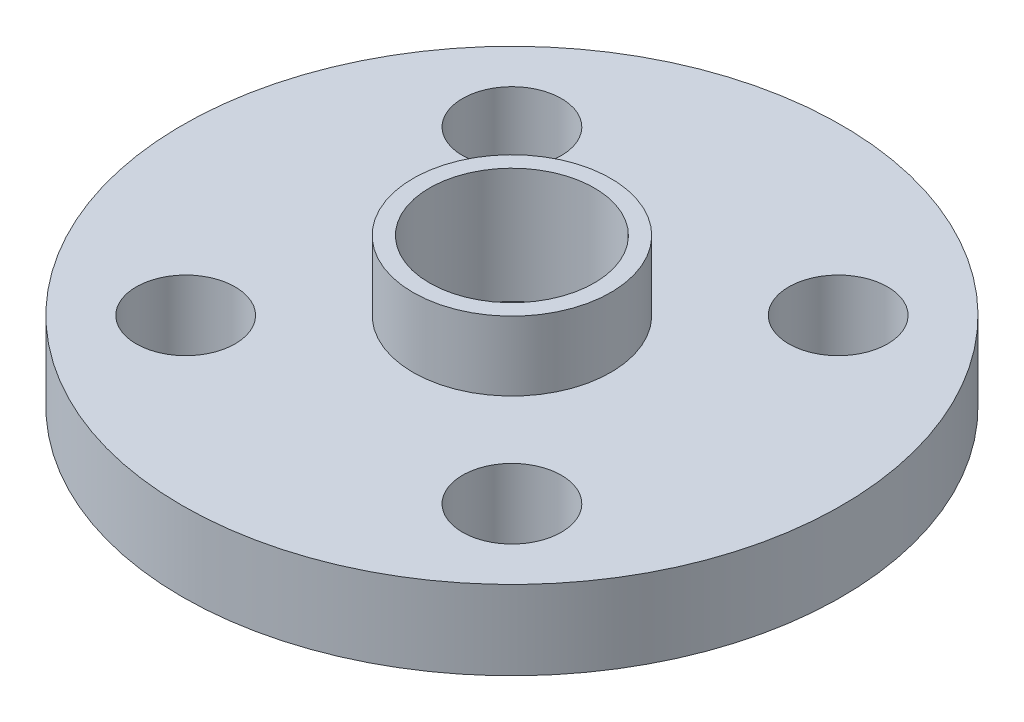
from build123d import *

# Parameters (mm, degrees)
BOSS_EXTRUDE1_DEPTH      = 2.4
BOSS_EXTRUDE1_DEPTH_BACK = 0.0001
SKETCH1_R                = 10
SKETCH1_R_2              = 1.5
SKETCH2_R                = 3
SKETCH2_R_2              = 2.5
BOSS_EXTRUDE2_DEPTH      = 2.1
CUT_EXTRUDE1_START       = -1.4
SKETCH7_R                = 2.5
CUT_EXTRUDE1_DEPTH       = 1.4
SKETCH8_R                = 1.5
CUT_EXTRUDE2_DEPTH       = 1.4


with BuildPart() as part:
    # Sketch1 → Boss-Extrude1 (new, two sides: drawn at the far end of the back side and taken through both)
    with BuildSketch(Plane(origin=(0, 0, 0), x_dir=(1, 0, 0), z_dir=(0, 1, 0)).offset(-BOSS_EXTRUDE1_DEPTH_BACK)):
        with Locations(Location((0, 0, 0), (0, 0, 270))):
            Circle(SKETCH1_R)
        with Locations(Location((4.949747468, -4.949747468, 0), (0, 0, 270))):
            Circle(SKETCH1_R_2, mode=Mode.SUBTRACT)
        with Locations(Location((-4.949747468, -4.949747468, 0), (0, 0, 270))):
            Circle(SKETCH1_R_2, mode=Mode.SUBTRACT)
        with Locations(Location((-4.949747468, 4.949747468, 0), (0, 0, 270))):
            Circle(SKETCH1_R_2, mode=Mode.SUBTRACT)
        with Locations(Location((4.949747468, 4.949747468, 0), (0, 0, 270))):
            Circle(SKETCH1_R_2, mode=Mode.SUBTRACT)
    extrude(amount=BOSS_EXTRUDE1_DEPTH + BOSS_EXTRUDE1_DEPTH_BACK)

    # Sketch2 → Boss-Extrude2 (add)
    with BuildSketch(Plane(origin=(0, 2.4, 0), x_dir=(1, 0, 0), z_dir=(0, 1, 0))):
        with Locations(Location((0, 0, 0), (0, 0, 270))):
            Circle(SKETCH2_R)
        with Locations(Location((0, 0, 0), (0, 0, 270))):
            Circle(SKETCH2_R_2, mode=Mode.SUBTRACT)
    extrude(amount=BOSS_EXTRUDE2_DEPTH)

    # Sketch7 → Cut-Extrude1 (cut)
    with BuildSketch(Plane(origin=(0, 2.4, 0), x_dir=(1, 0, 0), z_dir=(0, 1, 0)).offset(CUT_EXTRUDE1_START)):
        with Locations(Location((0, 0, 0), (0, 0, 270))):
            Circle(SKETCH7_R)
    extrude(amount=CUT_EXTRUDE1_DEPTH, mode=Mode.SUBTRACT)

    # Sketch8 → Cut-Extrude2 (cut)
    with BuildSketch(Plane(origin=(0, 1, 0), x_dir=(1, 0, 0), z_dir=(0, 1, 0))):
        with Locations(Location((0, 0, 0), (0, 0, 270))):
            Circle(SKETCH8_R)
    extrude(amount=-CUT_EXTRUDE2_DEPTH, mode=Mode.SUBTRACT)


solid = part.part
